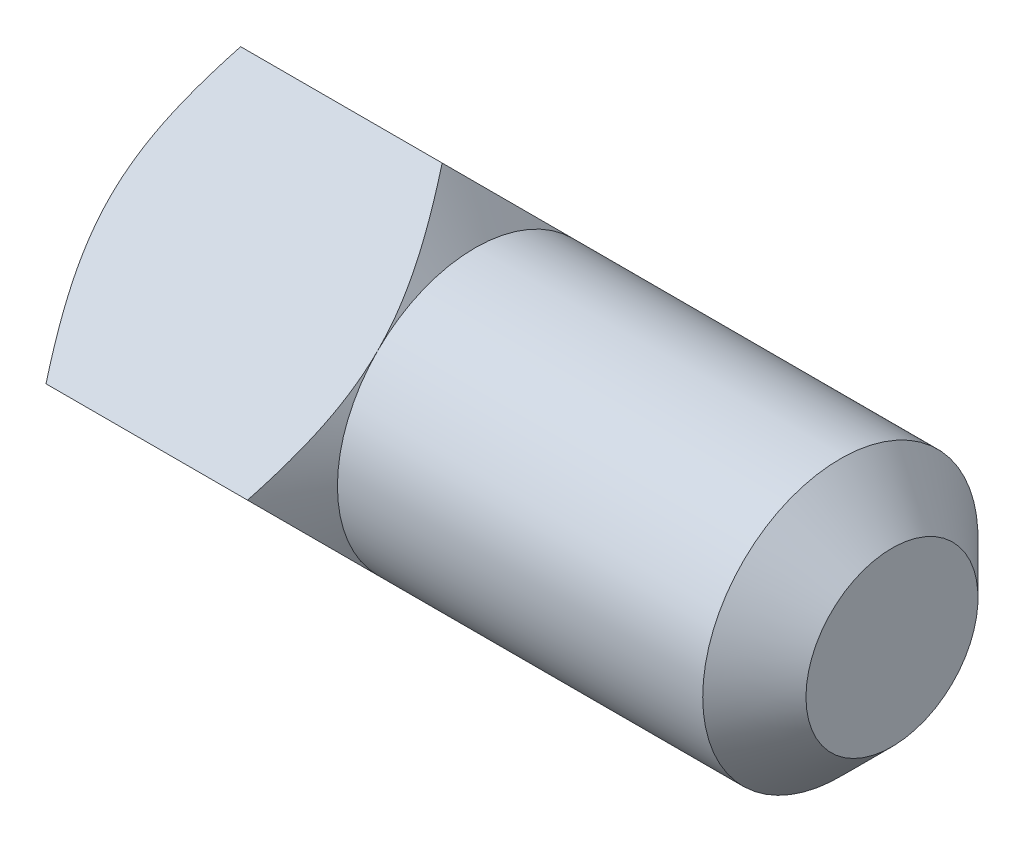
from build123d import *

# Parameters (mm, degrees)
BASEHEAD_DEPTH = 4
BODYSKE_W      = 6.53602765
BODYSKE_H      = 2


with BuildPart() as part:
    # BaseHeadSke → BaseHead (new body)
    with BuildSketch(Plane(origin=(0, 0, 0), x_dir=(0, 0, -1), z_dir=(1, 0, 0))):
        Polygon((0, 2.828427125), (2.828427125, 0), (0, -2.828427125), (-2.828427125, 0), align=None)
    extrude(amount=BASEHEAD_DEPTH)

    # HeadChamferSke → HeadChamfer (revolve, cut)
    with BuildSketch(Plane.XY, mode=Mode.PRIVATE) as headchamfer_sk:
        Polygon((0, 2.828427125), (0, 1.9), (0.53602765, 2.828427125), align=None)
        Polygon((3.46397235, 2.828427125), (4, 1.9), (4, 2.828427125), align=None)
    revolve(headchamfer_sk.sketch.rotate(Axis((0, 0, 0), (1, 0, 0)), 270), axis=Axis((0, 0, 0), (1, 0, 0)), mode=Mode.SUBTRACT)

    # BodySke → BaseBody (revolve)
    with BuildSketch(Plane.XY, mode=Mode.PRIVATE) as basebody_sk:
        with Locations((6.731986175, 1)):
            Rectangle(BODYSKE_W, BODYSKE_H)
    revolve(basebody_sk.sketch.rotate(Axis((0, 0, 0), (1, 0, 0)), 90), axis=Axis((0, 0, 0), (1, 0, 0)))

    # ChamferEndSke → ChamferEnd (revolve, cut)
    with BuildSketch(Plane.XY, mode=Mode.PRIVATE) as chamferend_sk:
        Polygon((10, 2), (10, 1.25), (9.25, 2), align=None)
    revolve(chamferend_sk.sketch.rotate(Axis((0, 0, 0), (1, 0, 0)), 90), axis=Axis((0, 0, 0), (1, 0, 0)), mode=Mode.SUBTRACT)


solid = part.part
